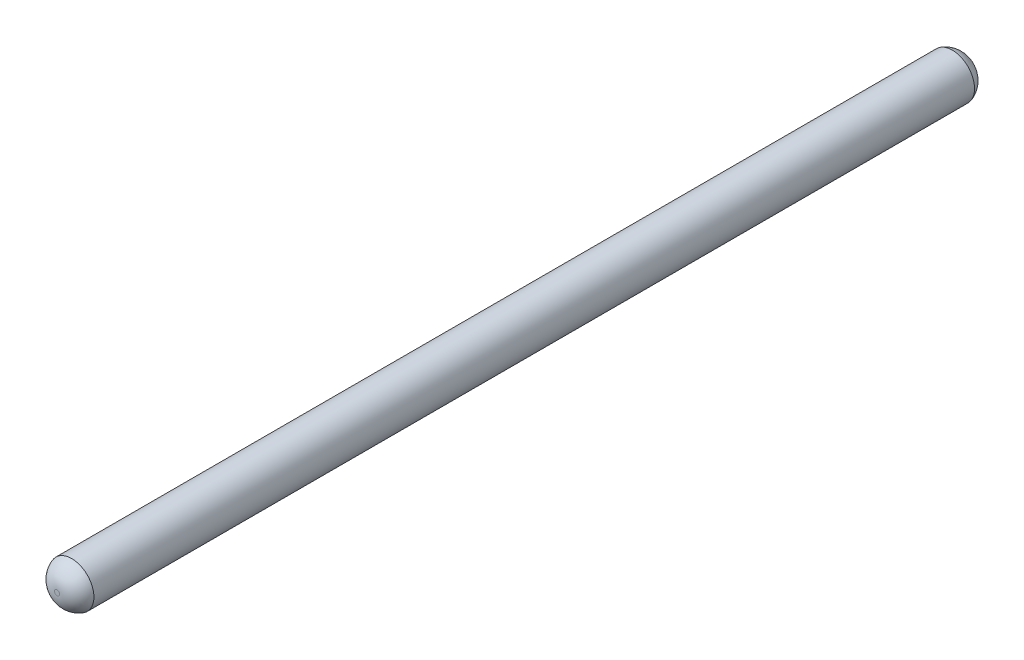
ISO-10303-21;
HEADER;
FILE_DESCRIPTION(('STEP AP214'),'2;1');
FILE_NAME('part.step','',(''),(''),'','','');
FILE_SCHEMA(('AUTOMOTIVE_DESIGN { 1 0 10303 214 1 1 1 1 }'));
ENDSEC;
DATA;
#1=APPLICATION_CONTEXT('core data for automotive mechanical design processes');
#2=APPLICATION_PROTOCOL_DEFINITION('international standard','automotive_design',2000,#1);
#3=PRODUCT_CONTEXT('',#1,'mechanical');
#4=PRODUCT('Part','Part','',(#3));
#5=PRODUCT_RELATED_PRODUCT_CATEGORY('part','',(#4));
#6=PRODUCT_DEFINITION_FORMATION('','',#4);
#7=PRODUCT_DEFINITION_CONTEXT('part definition',#1,'design');
#8=PRODUCT_DEFINITION('design','',#6,#7);
#9=PRODUCT_DEFINITION_SHAPE('','',#8);
#10=(LENGTH_UNIT() NAMED_UNIT(*) SI_UNIT(.MILLI.,.METRE.));
#11=(NAMED_UNIT(*) PLANE_ANGLE_UNIT() SI_UNIT($,.RADIAN.));
#12=(NAMED_UNIT(*) SI_UNIT($,.STERADIAN.) SOLID_ANGLE_UNIT());
#13=UNCERTAINTY_MEASURE_WITH_UNIT(LENGTH_MEASURE(1.E-05),#10,'distance_accuracy_value','');
#14=(GEOMETRIC_REPRESENTATION_CONTEXT(3) GLOBAL_UNCERTAINTY_ASSIGNED_CONTEXT((#13)) GLOBAL_UNIT_ASSIGNED_CONTEXT((#10,
#11,#12)) REPRESENTATION_CONTEXT('',''));
#15=CARTESIAN_POINT('',(0.,0.,0.));
#16=DIRECTION('',(0.,0.,1.));
#17=DIRECTION('',(1.,0.,0.));
#18=AXIS2_PLACEMENT_3D('',#15,#16,#17);
#19=CARTESIAN_POINT('',(0.,0.,-2.00000000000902));
#20=DIRECTION('',(0.,0.,1.));
#21=DIRECTION('',(0.853980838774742,0.520304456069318,0.));
#22=AXIS2_PLACEMENT_3D('',#19,#20,#21);
#23=DEGENERATE_TOROIDAL_SURFACE('',#22,0.750000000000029,6.,.T.);
#24=CARTESIAN_POINT('',(0.,0.,-3.71391365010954));
#25=DIRECTION('',(0.,0.,1.));
#26=DIRECTION('',(0.853980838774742,0.520304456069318,0.));
#27=AXIS2_PLACEMENT_3D('',#24,#25,#26);
#28=CIRCLE('',#27,6.5);
#29=CARTESIAN_POINT('',(5.55087545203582,3.38197896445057,-3.71391365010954));
#30=VERTEX_POINT('',#29);
#31=EDGE_CURVE('E8',#30,#30,#28,.T.);
#32=ORIENTED_EDGE('',*,*,#31,.F.);
#33=EDGE_LOOP('',(#32));
#34=FACE_BOUND('',#33,.T.);
#35=CARTESIAN_POINT('',(0.,0.,-8.00000000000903));
#36=DIRECTION('',(0.,0.,1.));
#37=DIRECTION('',(0.853980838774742,0.520304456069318,0.));
#38=AXIS2_PLACEMENT_3D('',#35,#36,#37);
#39=CIRCLE('',#38,0.750000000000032);
#40=CARTESIAN_POINT('',(0.640485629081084,0.390228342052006,-8.00000000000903));
#41=VERTEX_POINT('',#40);
#42=EDGE_CURVE('E20',#41,#41,#39,.T.);
#43=ORIENTED_EDGE('',*,*,#42,.T.);
#44=EDGE_LOOP('',(#43));
#45=FACE_BOUND('',#44,.T.);
#46=ADVANCED_FACE('F12',(#34,#45),#23,.T.);
#47=CARTESIAN_POINT('',(0.,0.,1.71354762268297));
#48=DIRECTION('',(0.,0.,1.));
#49=DIRECTION('',(0.853980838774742,0.520304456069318,0.));
#50=AXIS2_PLACEMENT_3D('',#47,#48,#49);
#51=CYLINDRICAL_SURFACE('',#50,6.5);
#52=ORIENTED_EDGE('',*,*,#31,.T.);
#53=EDGE_LOOP('',(#52));
#54=FACE_BOUND('',#53,.T.);
#55=CARTESIAN_POINT('',(0.,0.,253.71391365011));
#56=DIRECTION('',(0.,0.,-1.));
#57=DIRECTION('',(-0.988148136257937,0.153503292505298,0.));
#58=AXIS2_PLACEMENT_3D('',#55,#56,#57);
#59=CIRCLE('',#58,6.5);
#60=CARTESIAN_POINT('',(-6.42296288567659,0.997771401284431,253.71391365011));
#61=VERTEX_POINT('',#60);
#62=EDGE_CURVE('E16',#61,#61,#59,.T.);
#63=ORIENTED_EDGE('',*,*,#62,.T.);
#64=EDGE_LOOP('',(#63));
#65=FACE_BOUND('',#64,.T.);
#66=ADVANCED_FACE('F33',(#54,#65),#51,.T.);
#67=CARTESIAN_POINT('',(0.,0.,-8.00000000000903));
#68=DIRECTION('',(0.,0.,1.));
#69=DIRECTION('',(0.853980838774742,0.520304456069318,0.));
#70=AXIS2_PLACEMENT_3D('',#67,#68,#69);
#71=PLANE('',#70);
#72=ORIENTED_EDGE('',*,*,#42,.F.);
#73=EDGE_LOOP('',(#72));
#74=FACE_BOUND('',#73,.T.);
#75=ADVANCED_FACE('F42',(#74),#71,.F.);
#76=CARTESIAN_POINT('',(0.,0.,258.000000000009));
#77=DIRECTION('',(0.,0.,-1.));
#78=DIRECTION('',(-0.988148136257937,0.153503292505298,0.));
#79=AXIS2_PLACEMENT_3D('',#76,#77,#78);
#80=PLANE('',#79);
#81=CARTESIAN_POINT('',(0.,0.,258.000000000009));
#82=DIRECTION('',(0.,0.,-1.));
#83=DIRECTION('',(-0.988148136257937,0.153503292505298,0.));
#84=AXIS2_PLACEMENT_3D('',#81,#82,#83);
#85=CIRCLE('',#84,0.750000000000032);
#86=CARTESIAN_POINT('',(-0.741111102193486,0.115127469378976,258.000000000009));
#87=VERTEX_POINT('',#86);
#88=EDGE_CURVE('E26',#87,#87,#85,.T.);
#89=ORIENTED_EDGE('',*,*,#88,.F.);
#90=EDGE_LOOP('',(#89));
#91=FACE_BOUND('',#90,.T.);
#92=ADVANCED_FACE('F36',(#91),#80,.F.);
#93=CARTESIAN_POINT('',(0.,0.,252.000000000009));
#94=DIRECTION('',(0.,0.,-1.));
#95=DIRECTION('',(-0.988148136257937,0.153503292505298,0.));
#96=AXIS2_PLACEMENT_3D('',#93,#94,#95);
#97=DEGENERATE_TOROIDAL_SURFACE('',#96,0.750000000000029,6.,.T.);
#98=ORIENTED_EDGE('',*,*,#62,.F.);
#99=EDGE_LOOP('',(#98));
#100=FACE_BOUND('',#99,.T.);
#101=ORIENTED_EDGE('',*,*,#88,.T.);
#102=EDGE_LOOP('',(#101));
#103=FACE_BOUND('',#102,.T.);
#104=ADVANCED_FACE('F14',(#100,#103),#97,.T.);
#105=CLOSED_SHELL('',(#46,#66,#75,#92,#104));
#106=MANIFOLD_SOLID_BREP('B1',#105);
#107=ADVANCED_BREP_SHAPE_REPRESENTATION('',(#18,#106),#14);
#108=SHAPE_DEFINITION_REPRESENTATION(#9,#107);
ENDSEC;
END-ISO-10303-21;
